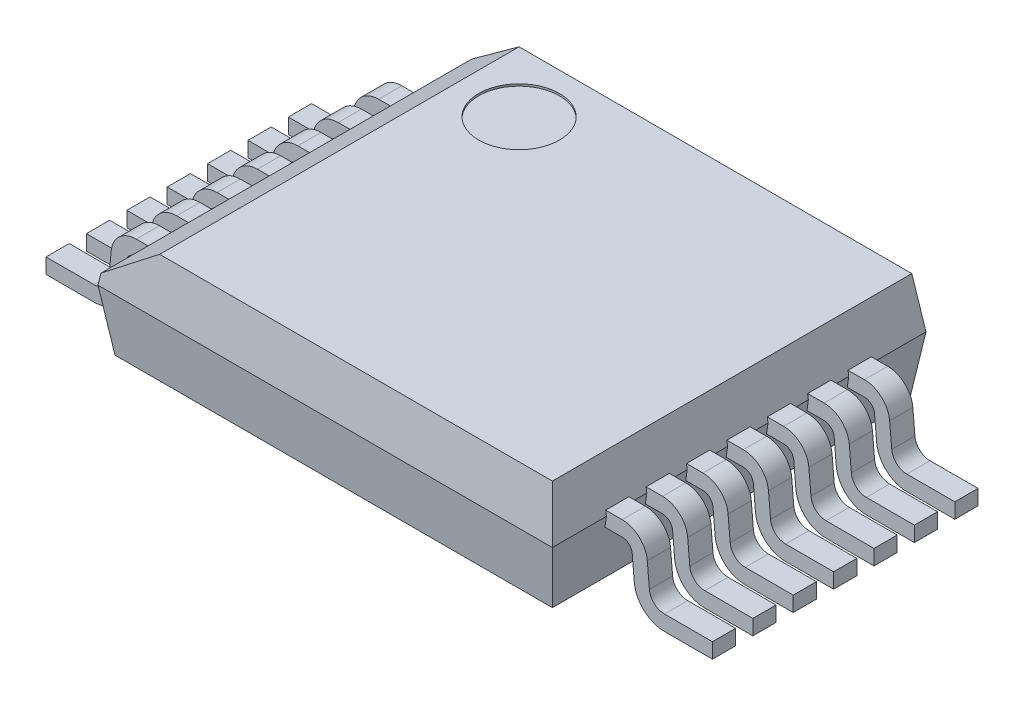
from build123d import *

# Parameters (mm, degrees)
EXTRUDE_1_DEPTH              = 0.115
SKETCH_4845_W                = 4.5
SKETCH_4845_H                = 3.7
EXTRUDE_4903_DEPTH           = 0.5
EXTRUDE_4903_TAPER           = 8
EXTRUDE_4903_OTHER_WAY_DEPTH = 0.6
EXTRUDE_4903_OTHER_WAY_TAPER = 8
PATTERN_LINEAR_4982_COUNT    = 7
PATTERN_LINEAR_4982_PITCH    = 0.4
CHAMFER_1_SIZE               = 0.4
CHAMFER_1_SIZE2              = 0.469982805
SKETCH_3_R                   = 0.4
CUT_EXTRUDE_3_DEPTH          = 0.02


with BuildPart() as part:
    # Sketch 1 → Extrude 1 (new, symmetric)
    with BuildSketch(Plane.XY.offset(-1.2)):
        with BuildLine():
            Line((-3.3, 0), (-2.824899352, 0))
            ThreePointArc((-2.824899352, 0), (-2.62222229, 0.078816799), (-2.526040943, 0.273853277))
            Line((-2.526040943, 0.273853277), (-2.505493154, 0.508715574))
            ThreePointArc((-2.505493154, 0.508715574), (-2.473432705, 0.573727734), (-2.405873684, 0.6))
            Line((-2.405873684, 0.6), (2.405873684, 0.6))
            ThreePointArc((2.405873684, 0.6), (2.473432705, 0.573727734), (2.505493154, 0.508715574))
            Line((2.505493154, 0.508715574), (2.526040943, 0.273853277))
            ThreePointArc((2.526040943, 0.273853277), (2.62222229, 0.078816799), (2.824899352, 0))
            Line((2.824899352, 0), (3.3, 0))
            Line((3.3, 0), (3.3, 0.15))
            Line((3.3, 0.15), (2.824899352, 0.15))
            ThreePointArc((2.824899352, 0.15), (2.723560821, 0.189408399), (2.675470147, 0.286926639))
            Line((2.675470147, 0.286926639), (2.654922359, 0.521788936))
            ThreePointArc((2.654922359, 0.521788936), (2.574771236, 0.684319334), (2.405873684, 0.75))
            Line((2.405873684, 0.75), (-2.405873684, 0.75))
            ThreePointArc((-2.405873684, 0.75), (-2.574771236, 0.684319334), (-2.654922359, 0.521788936))
            Line((-2.654922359, 0.521788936), (-2.675470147, 0.286926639))
            ThreePointArc((-2.675470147, 0.286926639), (-2.723560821, 0.189408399), (-2.824899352, 0.15))
            Line((-2.824899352, 0.15), (-3.3, 0.15))
            Line((-3.3, 0.15), (-3.3, 0))
        make_face()
    extrude_1 = extrude(amount=EXTRUDE_1_DEPTH, both=True)

    # Sketch 4845 → Extrude 4903 (add)
    with BuildSketch(Plane(origin=(0, 0.7, 0), x_dir=(1, 0, 0), z_dir=(0, 1, 0))):
        Rectangle(SKETCH_4845_W, SKETCH_4845_H)
    extrude(amount=EXTRUDE_4903_DEPTH, taper=EXTRUDE_4903_TAPER)

    # Sketch 4845 → Extrude 4903 other way (add)
    with BuildSketch(Plane(origin=(0, 0.7, 0), x_dir=(1, 0, 0), z_dir=(0, 1, 0))):
        Rectangle(SKETCH_4845_W, SKETCH_4845_H)
    extrude(amount=-EXTRUDE_4903_OTHER_WAY_DEPTH, taper=EXTRUDE_4903_OTHER_WAY_TAPER)

    # Pattern Linear 4982: Extrude 1 ×7
    with Locations(*[(0, 0, i * PATTERN_LINEAR_4982_PITCH) for i in range(1, PATTERN_LINEAR_4982_COUNT)]):
        add(extrude_1)

    # Chamfer 1
    chamfer_1_edges = [part.edges().sort_by_distance(p)[0] for p in [
        (-2.179729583, 1.2, 0),
    ]]
    chamfer_1_side = [part.faces().sort_by_distance(p)[0] for p in [
        (-2.213634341, 0.95875511, 0),
    ]]
    chamfer(chamfer_1_edges, length=CHAMFER_1_SIZE, length2=CHAMFER_1_SIZE2, reference=chamfer_1_side[0])

    # Sketch 3 → Cut-Extrude 3 (cut)
    with BuildSketch(Plane(origin=(0, 1.2, 0), x_dir=(1, 0, 0), z_dir=(0, 1, 0))):
        with Locations(Location((-1.109746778, 1.179729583, 0), (0, 0, 270))):
            Circle(SKETCH_3_R)
    extrude(amount=-CUT_EXTRUDE_3_DEPTH, mode=Mode.SUBTRACT)


solid = part.part
